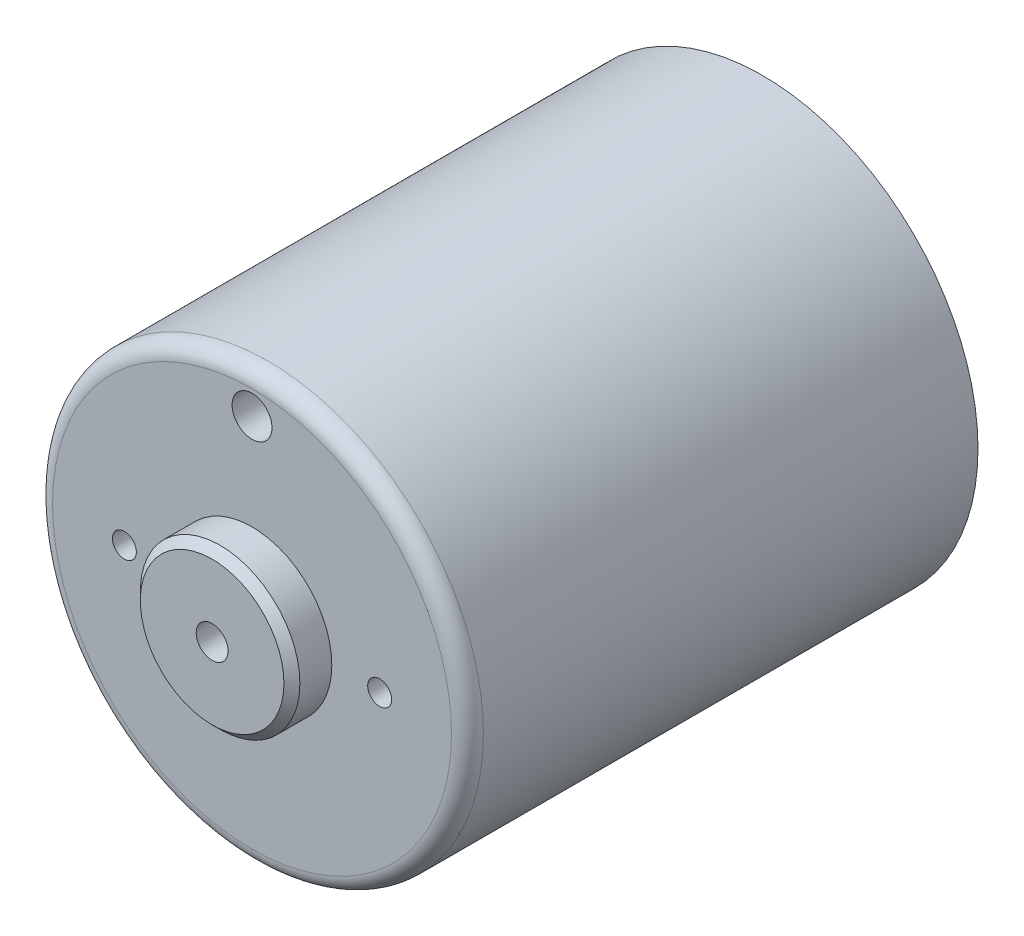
ISO-10303-21;
HEADER;
FILE_DESCRIPTION(('STEP AP214'),'2;1');
FILE_NAME('part.step','',(''),(''),'','','');
FILE_SCHEMA(('AUTOMOTIVE_DESIGN { 1 0 10303 214 1 1 1 1 }'));
ENDSEC;
DATA;
#1=APPLICATION_CONTEXT('core data for automotive mechanical design processes');
#2=APPLICATION_PROTOCOL_DEFINITION('international standard','automotive_design',2000,#1);
#3=PRODUCT_CONTEXT('',#1,'mechanical');
#4=PRODUCT('Part','Part','',(#3));
#5=PRODUCT_RELATED_PRODUCT_CATEGORY('part','',(#4));
#6=PRODUCT_DEFINITION_FORMATION('','',#4);
#7=PRODUCT_DEFINITION_CONTEXT('part definition',#1,'design');
#8=PRODUCT_DEFINITION('design','',#6,#7);
#9=PRODUCT_DEFINITION_SHAPE('','',#8);
#10=(LENGTH_UNIT() NAMED_UNIT(*) SI_UNIT(.MILLI.,.METRE.));
#11=(NAMED_UNIT(*) PLANE_ANGLE_UNIT() SI_UNIT($,.RADIAN.));
#12=(NAMED_UNIT(*) SI_UNIT($,.STERADIAN.) SOLID_ANGLE_UNIT());
#13=UNCERTAINTY_MEASURE_WITH_UNIT(LENGTH_MEASURE(1.E-05),#10,'distance_accuracy_value','');
#14=(GEOMETRIC_REPRESENTATION_CONTEXT(3) GLOBAL_UNCERTAINTY_ASSIGNED_CONTEXT((#13)) GLOBAL_UNIT_ASSIGNED_CONTEXT((#10,
#11,#12)) REPRESENTATION_CONTEXT('',''));
#15=CARTESIAN_POINT('',(0.,0.,0.));
#16=DIRECTION('',(0.,0.,1.));
#17=DIRECTION('',(1.,0.,0.));
#18=AXIS2_PLACEMENT_3D('',#15,#16,#17);
#19=CARTESIAN_POINT('',(0.,0.,16.));
#20=DIRECTION('',(0.,0.,1.));
#21=DIRECTION('',(1.,0.,0.));
#22=AXIS2_PLACEMENT_3D('',#19,#20,#21);
#23=PLANE('',#22);
#24=CARTESIAN_POINT('',(0.,11.,16.));
#25=DIRECTION('',(0.,0.,1.));
#26=DIRECTION('',(1.,0.,0.));
#27=AXIS2_PLACEMENT_3D('',#24,#25,#26);
#28=CIRCLE('',#27,1.25);
#29=CARTESIAN_POINT('',(1.25,11.,16.));
#30=VERTEX_POINT('',#29);
#31=EDGE_CURVE('E211',#30,#30,#28,.T.);
#32=ORIENTED_EDGE('',*,*,#31,.F.);
#33=EDGE_LOOP('',(#32));
#34=FACE_BOUND('',#33,.T.);
#35=CARTESIAN_POINT('',(-8.,0.,15.999999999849));
#36=DIRECTION('',(0.,0.,1.));
#37=DIRECTION('',(-1.,0.,0.));
#38=AXIS2_PLACEMENT_3D('',#35,#36,#37);
#39=CIRCLE('',#38,0.75);
#40=CARTESIAN_POINT('',(-8.75,0.,15.999999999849));
#41=VERTEX_POINT('',#40);
#42=EDGE_CURVE('E55',#41,#41,#39,.T.);
#43=ORIENTED_EDGE('',*,*,#42,.F.);
#44=EDGE_LOOP('',(#43));
#45=FACE_BOUND('',#44,.T.);
#46=CARTESIAN_POINT('',(8.,0.,15.999999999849));
#47=DIRECTION('',(0.,0.,1.));
#48=DIRECTION('',(1.,0.,0.));
#49=AXIS2_PLACEMENT_3D('',#46,#47,#48);
#50=CIRCLE('',#49,0.75);
#51=CARTESIAN_POINT('',(8.75,0.,15.999999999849));
#52=VERTEX_POINT('',#51);
#53=EDGE_CURVE('E68',#52,#52,#50,.T.);
#54=ORIENTED_EDGE('',*,*,#53,.F.);
#55=EDGE_LOOP('',(#54));
#56=FACE_BOUND('',#55,.T.);
#57=CARTESIAN_POINT('',(0.,0.,16.));
#58=DIRECTION('',(0.,0.,1.));
#59=DIRECTION('',(1.,0.,0.));
#60=AXIS2_PLACEMENT_3D('',#57,#58,#59);
#61=CIRCLE('',#60,12.5);
#62=CARTESIAN_POINT('',(12.5,0.,16.));
#63=VERTEX_POINT('',#62);
#64=EDGE_CURVE('E77',#63,#63,#61,.T.);
#65=ORIENTED_EDGE('',*,*,#64,.T.);
#66=EDGE_LOOP('',(#65));
#67=FACE_BOUND('',#66,.T.);
#68=CARTESIAN_POINT('',(0.,0.,16.));
#69=DIRECTION('',(0.,0.,1.));
#70=DIRECTION('',(1.,0.,0.));
#71=AXIS2_PLACEMENT_3D('',#68,#69,#70);
#72=CIRCLE('',#71,5.);
#73=CARTESIAN_POINT('',(5.,0.,16.));
#74=VERTEX_POINT('',#73);
#75=EDGE_CURVE('E71',#74,#74,#72,.T.);
#76=ORIENTED_EDGE('',*,*,#75,.F.);
#77=EDGE_LOOP('',(#76));
#78=FACE_BOUND('',#77,.T.);
#79=ADVANCED_FACE('F31',(#34,#45,#56,#67,#78),#23,.T.);
#80=CARTESIAN_POINT('',(0.,0.,16.));
#81=DIRECTION('',(0.,0.,-1.));
#82=DIRECTION('',(-1.,0.,0.));
#83=AXIS2_PLACEMENT_3D('',#80,#81,#82);
#84=CYLINDRICAL_SURFACE('',#83,13.5);
#85=CARTESIAN_POINT('',(0.,0.,15.));
#86=DIRECTION('',(0.,0.,1.));
#87=DIRECTION('',(1.,0.,0.));
#88=AXIS2_PLACEMENT_3D('',#85,#86,#87);
#89=CIRCLE('',#88,13.5);
#90=CARTESIAN_POINT('',(13.5,0.,15.));
#91=VERTEX_POINT('',#90);
#92=EDGE_CURVE('E80',#91,#91,#89,.F.);
#93=ORIENTED_EDGE('',*,*,#92,.T.);
#94=EDGE_LOOP('',(#93));
#95=FACE_BOUND('',#94,.T.);
#96=CARTESIAN_POINT('',(0.,0.,-16.));
#97=DIRECTION('',(0.,0.,1.));
#98=DIRECTION('',(1.,0.,0.));
#99=AXIS2_PLACEMENT_3D('',#96,#97,#98);
#100=CIRCLE('',#99,13.5);
#101=CARTESIAN_POINT('',(13.5,0.,-16.));
#102=VERTEX_POINT('',#101);
#103=EDGE_CURVE('E74',#102,#102,#100,.T.);
#104=ORIENTED_EDGE('',*,*,#103,.T.);
#105=EDGE_LOOP('',(#104));
#106=FACE_BOUND('',#105,.T.);
#107=ADVANCED_FACE('F33',(#95,#106),#84,.T.);
#108=CARTESIAN_POINT('',(0.,0.,-16.));
#109=DIRECTION('',(0.,0.,1.));
#110=DIRECTION('',(1.,0.,0.));
#111=AXIS2_PLACEMENT_3D('',#108,#109,#110);
#112=PLANE('',#111);
#113=ORIENTED_EDGE('',*,*,#103,.F.);
#114=EDGE_LOOP('',(#113));
#115=FACE_BOUND('',#114,.T.);
#116=ADVANCED_FACE('F108',(#115),#112,.F.);
#117=CARTESIAN_POINT('',(0.,0.,15.));
#118=DIRECTION('',(0.,0.,1.));
#119=DIRECTION('',(1.,0.,0.));
#120=AXIS2_PLACEMENT_3D('',#117,#118,#119);
#121=TOROIDAL_SURFACE('',#120,12.5,1.);
#122=ORIENTED_EDGE('',*,*,#92,.F.);
#123=EDGE_LOOP('',(#122));
#124=FACE_BOUND('',#123,.T.);
#125=ORIENTED_EDGE('',*,*,#64,.F.);
#126=EDGE_LOOP('',(#125));
#127=FACE_BOUND('',#126,.T.);
#128=ADVANCED_FACE('F115',(#124,#127),#121,.T.);
#129=CARTESIAN_POINT('',(0.,0.,18.5));
#130=DIRECTION('',(0.,0.,-1.));
#131=DIRECTION('',(-1.,0.,0.));
#132=AXIS2_PLACEMENT_3D('',#129,#130,#131);
#133=CYLINDRICAL_SURFACE('',#132,5.);
#134=CARTESIAN_POINT('',(0.,0.,18.));
#135=DIRECTION('',(0.,0.,1.));
#136=DIRECTION('',(1.,0.,0.));
#137=AXIS2_PLACEMENT_3D('',#134,#135,#136);
#138=CIRCLE('',#137,5.);
#139=CARTESIAN_POINT('',(5.,0.,18.));
#140=VERTEX_POINT('',#139);
#141=EDGE_CURVE('E11',#140,#140,#138,.F.);
#142=ORIENTED_EDGE('',*,*,#141,.T.);
#143=EDGE_LOOP('',(#142));
#144=FACE_BOUND('',#143,.T.);
#145=ORIENTED_EDGE('',*,*,#75,.T.);
#146=EDGE_LOOP('',(#145));
#147=FACE_BOUND('',#146,.T.);
#148=ADVANCED_FACE('F99',(#144,#147),#133,.T.);
#149=CARTESIAN_POINT('',(0.,0.,18.5));
#150=DIRECTION('',(0.,0.,1.));
#151=DIRECTION('',(1.,0.,0.));
#152=AXIS2_PLACEMENT_3D('',#149,#150,#151);
#153=PLANE('',#152);
#154=CARTESIAN_POINT('',(0.,0.,18.5));
#155=DIRECTION('',(0.,0.,1.));
#156=DIRECTION('',(1.,0.,0.));
#157=AXIS2_PLACEMENT_3D('',#154,#155,#156);
#158=CIRCLE('',#157,1.);
#159=CARTESIAN_POINT('',(1.,0.,18.5));
#160=VERTEX_POINT('',#159);
#161=EDGE_CURVE('E62',#160,#160,#158,.T.);
#162=ORIENTED_EDGE('',*,*,#161,.F.);
#163=EDGE_LOOP('',(#162));
#164=FACE_BOUND('',#163,.T.);
#165=CARTESIAN_POINT('',(0.,0.,18.5));
#166=DIRECTION('',(0.,0.,1.));
#167=DIRECTION('',(1.,0.,0.));
#168=AXIS2_PLACEMENT_3D('',#165,#166,#167);
#169=CIRCLE('',#168,4.5);
#170=CARTESIAN_POINT('',(4.5,0.,18.5));
#171=VERTEX_POINT('',#170);
#172=EDGE_CURVE('E39',#171,#171,#169,.T.);
#173=ORIENTED_EDGE('',*,*,#172,.T.);
#174=EDGE_LOOP('',(#173));
#175=FACE_BOUND('',#174,.T.);
#176=ADVANCED_FACE('F85',(#164,#175),#153,.T.);
#177=CARTESIAN_POINT('',(0.,0.,18.5));
#178=DIRECTION('',(0.,0.,-1.));
#179=DIRECTION('',(-1.,0.,0.));
#180=AXIS2_PLACEMENT_3D('',#177,#178,#179);
#181=CONICAL_SURFACE('',#180,4.5,0.785398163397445);
#182=ORIENTED_EDGE('',*,*,#141,.F.);
#183=EDGE_LOOP('',(#182));
#184=FACE_BOUND('',#183,.T.);
#185=ORIENTED_EDGE('',*,*,#172,.F.);
#186=EDGE_LOOP('',(#185));
#187=FACE_BOUND('',#186,.T.);
#188=ADVANCED_FACE('F87',(#184,#187),#181,.T.);
#189=CARTESIAN_POINT('',(8.,0.,5.99999999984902));
#190=DIRECTION('',(0.,0.,1.));
#191=DIRECTION('',(1.,0.,0.));
#192=AXIS2_PLACEMENT_3D('',#189,#190,#191);
#193=CYLINDRICAL_SURFACE('',#192,0.75);
#194=CARTESIAN_POINT('',(8.,0.,5.99999999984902));
#195=DIRECTION('',(0.,0.,1.));
#196=DIRECTION('',(1.,0.,0.));
#197=AXIS2_PLACEMENT_3D('',#194,#195,#196);
#198=CIRCLE('',#197,0.75);
#199=CARTESIAN_POINT('',(8.75,0.,5.99999999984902));
#200=VERTEX_POINT('',#199);
#201=EDGE_CURVE('E59',#200,#200,#198,.T.);
#202=ORIENTED_EDGE('',*,*,#201,.F.);
#203=EDGE_LOOP('',(#202));
#204=FACE_BOUND('',#203,.T.);
#205=ORIENTED_EDGE('',*,*,#53,.T.);
#206=EDGE_LOOP('',(#205));
#207=FACE_BOUND('',#206,.T.);
#208=ADVANCED_FACE('F89',(#204,#207),#193,.F.);
#209=CARTESIAN_POINT('',(8.,0.,5.99999999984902));
#210=DIRECTION('',(0.,0.,1.));
#211=DIRECTION('',(1.,0.,0.));
#212=AXIS2_PLACEMENT_3D('',#209,#210,#211);
#213=CONICAL_SURFACE('',#212,0.75,1.0471975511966);
#214=CARTESIAN_POINT('',(8.,0.,5.56698729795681));
#215=VERTEX_POINT('',#214);
#216=VERTEX_LOOP('',#215);
#217=FACE_BOUND('',#216,.T.);
#218=ORIENTED_EDGE('',*,*,#201,.T.);
#219=EDGE_LOOP('',(#218));
#220=FACE_BOUND('',#219,.T.);
#221=ADVANCED_FACE('F96',(#217,#220),#213,.F.);
#222=CARTESIAN_POINT('',(-8.,0.,5.99999999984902));
#223=DIRECTION('',(0.,0.,1.));
#224=DIRECTION('',(1.,0.,0.));
#225=AXIS2_PLACEMENT_3D('',#222,#223,#224);
#226=CYLINDRICAL_SURFACE('',#225,0.75);
#227=CARTESIAN_POINT('',(-8.,0.,5.99999999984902));
#228=DIRECTION('',(0.,0.,1.));
#229=DIRECTION('',(-1.,0.,0.));
#230=AXIS2_PLACEMENT_3D('',#227,#228,#229);
#231=CIRCLE('',#230,0.75);
#232=CARTESIAN_POINT('',(-8.75,0.,5.99999999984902));
#233=VERTEX_POINT('',#232);
#234=EDGE_CURVE('E53',#233,#233,#231,.T.);
#235=ORIENTED_EDGE('',*,*,#234,.F.);
#236=EDGE_LOOP('',(#235));
#237=FACE_BOUND('',#236,.T.);
#238=ORIENTED_EDGE('',*,*,#42,.T.);
#239=EDGE_LOOP('',(#238));
#240=FACE_BOUND('',#239,.T.);
#241=ADVANCED_FACE('F49',(#237,#240),#226,.F.);
#242=CARTESIAN_POINT('',(-8.,0.,5.99999999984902));
#243=DIRECTION('',(0.,0.,1.));
#244=DIRECTION('',(-1.,0.,0.));
#245=AXIS2_PLACEMENT_3D('',#242,#243,#244);
#246=CONICAL_SURFACE('',#245,0.75,1.0471975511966);
#247=CARTESIAN_POINT('',(-8.,0.,5.56698729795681));
#248=VERTEX_POINT('',#247);
#249=VERTEX_LOOP('',#248);
#250=FACE_BOUND('',#249,.T.);
#251=ORIENTED_EDGE('',*,*,#234,.T.);
#252=EDGE_LOOP('',(#251));
#253=FACE_BOUND('',#252,.T.);
#254=ADVANCED_FACE('F45',(#250,#253),#246,.F.);
#255=CARTESIAN_POINT('',(0.,0.,13.5));
#256=DIRECTION('',(0.,0.,1.));
#257=DIRECTION('',(1.,0.,0.));
#258=AXIS2_PLACEMENT_3D('',#255,#256,#257);
#259=CYLINDRICAL_SURFACE('',#258,1.);
#260=CARTESIAN_POINT('',(0.,0.,13.5));
#261=DIRECTION('',(0.,0.,1.));
#262=DIRECTION('',(1.,0.,0.));
#263=AXIS2_PLACEMENT_3D('',#260,#261,#262);
#264=CIRCLE('',#263,1.);
#265=CARTESIAN_POINT('',(1.,0.,13.5));
#266=VERTEX_POINT('',#265);
#267=EDGE_CURVE('E56',#266,#266,#264,.T.);
#268=ORIENTED_EDGE('',*,*,#267,.F.);
#269=EDGE_LOOP('',(#268));
#270=FACE_BOUND('',#269,.T.);
#271=ORIENTED_EDGE('',*,*,#161,.T.);
#272=EDGE_LOOP('',(#271));
#273=FACE_BOUND('',#272,.T.);
#274=ADVANCED_FACE('F48',(#270,#273),#259,.F.);
#275=CARTESIAN_POINT('',(0.,0.,13.5));
#276=DIRECTION('',(0.,0.,1.));
#277=DIRECTION('',(1.,0.,0.));
#278=AXIS2_PLACEMENT_3D('',#275,#276,#277);
#279=PLANE('',#278);
#280=ORIENTED_EDGE('',*,*,#267,.T.);
#281=EDGE_LOOP('',(#280));
#282=FACE_BOUND('',#281,.T.);
#283=ADVANCED_FACE('F174',(#282),#279,.T.);
#284=CARTESIAN_POINT('',(0.,11.,13.));
#285=DIRECTION('',(0.,0.,1.));
#286=DIRECTION('',(1.,0.,0.));
#287=AXIS2_PLACEMENT_3D('',#284,#285,#286);
#288=CYLINDRICAL_SURFACE('',#287,1.25);
#289=CARTESIAN_POINT('',(0.,11.,13.));
#290=DIRECTION('',(0.,0.,1.));
#291=DIRECTION('',(1.,0.,0.));
#292=AXIS2_PLACEMENT_3D('',#289,#290,#291);
#293=CIRCLE('',#292,1.25);
#294=CARTESIAN_POINT('',(1.25,11.,13.));
#295=VERTEX_POINT('',#294);
#296=EDGE_CURVE('E210',#295,#295,#293,.T.);
#297=ORIENTED_EDGE('',*,*,#296,.F.);
#298=EDGE_LOOP('',(#297));
#299=FACE_BOUND('',#298,.T.);
#300=ORIENTED_EDGE('',*,*,#31,.T.);
#301=EDGE_LOOP('',(#300));
#302=FACE_BOUND('',#301,.T.);
#303=ADVANCED_FACE('F184',(#299,#302),#288,.F.);
#304=CARTESIAN_POINT('',(0.,11.,13.));
#305=DIRECTION('',(0.,0.,1.));
#306=DIRECTION('',(1.,0.,0.));
#307=AXIS2_PLACEMENT_3D('',#304,#305,#306);
#308=PLANE('',#307);
#309=ORIENTED_EDGE('',*,*,#296,.T.);
#310=EDGE_LOOP('',(#309));
#311=FACE_BOUND('',#310,.T.);
#312=ADVANCED_FACE('F194',(#311),#308,.T.);
#313=CLOSED_SHELL('',(#79,#107,#116,#128,#148,#176,#188,#208,#221,#241,#254,#274,#283,#303,#312));
#314=MANIFOLD_SOLID_BREP('B2',#313);
#315=ADVANCED_BREP_SHAPE_REPRESENTATION('',(#18,#314),#14);
#316=SHAPE_DEFINITION_REPRESENTATION(#9,#315);
ENDSEC;
END-ISO-10303-21;
